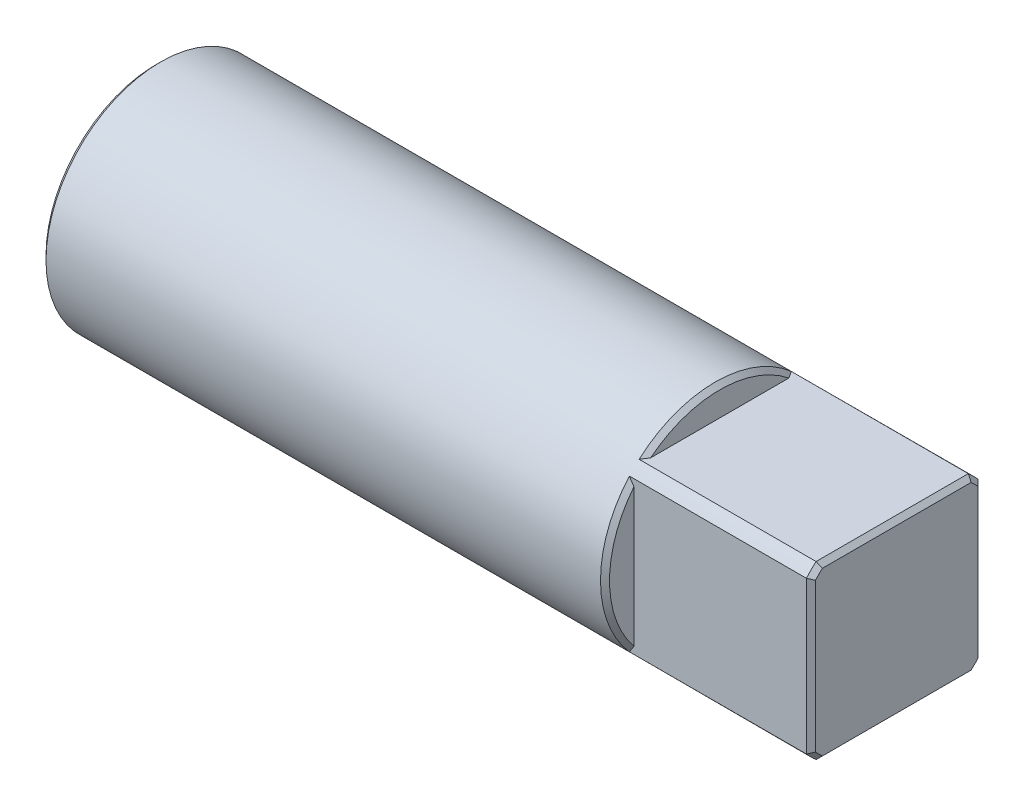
ISO-10303-21;
HEADER;
FILE_DESCRIPTION(('STEP AP214'),'2;1');
FILE_NAME('part.step','',(''),(''),'','','');
FILE_SCHEMA(('AUTOMOTIVE_DESIGN { 1 0 10303 214 1 1 1 1 }'));
ENDSEC;
DATA;
#1=APPLICATION_CONTEXT('core data for automotive mechanical design processes');
#2=APPLICATION_PROTOCOL_DEFINITION('international standard','automotive_design',2000,#1);
#3=PRODUCT_CONTEXT('',#1,'mechanical');
#4=PRODUCT('Part','Part','',(#3));
#5=PRODUCT_RELATED_PRODUCT_CATEGORY('part','',(#4));
#6=PRODUCT_DEFINITION_FORMATION('','',#4);
#7=PRODUCT_DEFINITION_CONTEXT('part definition',#1,'design');
#8=PRODUCT_DEFINITION('design','',#6,#7);
#9=PRODUCT_DEFINITION_SHAPE('','',#8);
#10=(LENGTH_UNIT() NAMED_UNIT(*) SI_UNIT(.MILLI.,.METRE.));
#11=(NAMED_UNIT(*) PLANE_ANGLE_UNIT() SI_UNIT($,.RADIAN.));
#12=(NAMED_UNIT(*) SI_UNIT($,.STERADIAN.) SOLID_ANGLE_UNIT());
#13=UNCERTAINTY_MEASURE_WITH_UNIT(LENGTH_MEASURE(1.E-05),#10,'distance_accuracy_value','');
#14=(GEOMETRIC_REPRESENTATION_CONTEXT(3) GLOBAL_UNCERTAINTY_ASSIGNED_CONTEXT((#13)) GLOBAL_UNIT_ASSIGNED_CONTEXT((#10,
#11,#12)) REPRESENTATION_CONTEXT('',''));
#15=CARTESIAN_POINT('',(0.,0.,0.));
#16=DIRECTION('',(0.,0.,1.));
#17=DIRECTION('',(1.,0.,0.));
#18=AXIS2_PLACEMENT_3D('',#15,#16,#17);
#19=CARTESIAN_POINT('',(41.,0.,0.));
#20=DIRECTION('',(-1.,0.,0.));
#21=DIRECTION('',(0.,0.,1.));
#22=AXIS2_PLACEMENT_3D('',#19,#20,#21);
#23=CYLINDRICAL_SURFACE('',#22,6.35);
#24=CARTESIAN_POINT('',(0.249999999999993,0.,0.));
#25=DIRECTION('',(1.,0.,0.));
#26=DIRECTION('',(0.,0.,-1.));
#27=AXIS2_PLACEMENT_3D('',#24,#25,#26);
#28=CIRCLE('',#27,6.35);
#29=CARTESIAN_POINT('',(0.249999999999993,0.,-6.35));
#30=VERTEX_POINT('',#29);
#31=EDGE_CURVE('E181',#30,#30,#28,.T.);
#32=ORIENTED_EDGE('',*,*,#31,.T.);
#33=EDGE_LOOP('',(#32));
#34=FACE_BOUND('',#33,.T.);
#35=DIRECTION('',(-1.,0.,0.));
#36=VECTOR('',#35,1.);
#37=CARTESIAN_POINT('',(41.,4.75,-4.2142615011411));
#38=LINE('',#37,#36);
#39=CARTESIAN_POINT('',(40.75,4.75,-4.2142615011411));
#40=VERTEX_POINT('',#39);
#41=CARTESIAN_POINT('',(30.95,4.75,-4.2142615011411));
#42=VERTEX_POINT('',#41);
#43=EDGE_CURVE('E397',#40,#42,#38,.T.);
#44=ORIENTED_EDGE('',*,*,#43,.F.);
#45=CARTESIAN_POINT('',(40.75,0.,0.));
#46=DIRECTION('',(1.,0.,0.));
#47=DIRECTION('',(0.,0.,-1.));
#48=AXIS2_PLACEMENT_3D('',#45,#46,#47);
#49=CIRCLE('',#48,6.35);
#50=CARTESIAN_POINT('',(40.75,4.21426150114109,-4.75));
#51=VERTEX_POINT('',#50);
#52=EDGE_CURVE('E207',#40,#51,#49,.F.);
#53=ORIENTED_EDGE('',*,*,#52,.T.);
#54=DIRECTION('',(-1.,0.,0.));
#55=VECTOR('',#54,1.);
#56=CARTESIAN_POINT('',(41.,4.21426150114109,-4.75));
#57=LINE('',#56,#55);
#58=CARTESIAN_POINT('',(30.95,4.21426150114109,-4.75));
#59=VERTEX_POINT('',#58);
#60=EDGE_CURVE('E438',#59,#51,#57,.F.);
#61=ORIENTED_EDGE('',*,*,#60,.F.);
#62=CARTESIAN_POINT('',(30.95,0.,0.));
#63=DIRECTION('',(1.,0.,0.));
#64=DIRECTION('',(0.,0.,-1.));
#65=AXIS2_PLACEMENT_3D('',#62,#63,#64);
#66=CIRCLE('',#65,6.35);
#67=CARTESIAN_POINT('',(30.95,-4.21426150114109,-4.75));
#68=VERTEX_POINT('',#67);
#69=EDGE_CURVE('E195',#59,#68,#66,.F.);
#70=ORIENTED_EDGE('',*,*,#69,.T.);
#71=DIRECTION('',(-1.,0.,0.));
#72=VECTOR('',#71,1.);
#73=CARTESIAN_POINT('',(41.,-4.21426150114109,-4.75));
#74=LINE('',#73,#72);
#75=CARTESIAN_POINT('',(40.75,-4.21426150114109,-4.75));
#76=VERTEX_POINT('',#75);
#77=EDGE_CURVE('E440',#76,#68,#74,.T.);
#78=ORIENTED_EDGE('',*,*,#77,.F.);
#79=CARTESIAN_POINT('',(40.75,0.,0.));
#80=DIRECTION('',(1.,0.,0.));
#81=DIRECTION('',(0.,0.,-1.));
#82=AXIS2_PLACEMENT_3D('',#79,#80,#81);
#83=CIRCLE('',#82,6.35);
#84=CARTESIAN_POINT('',(40.75,-4.75,-4.21426150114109));
#85=VERTEX_POINT('',#84);
#86=EDGE_CURVE('E205',#76,#85,#83,.F.);
#87=ORIENTED_EDGE('',*,*,#86,.T.);
#88=DIRECTION('',(-1.,0.,0.));
#89=VECTOR('',#88,1.);
#90=CARTESIAN_POINT('',(41.,-4.75,-4.21426150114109));
#91=LINE('',#90,#89);
#92=CARTESIAN_POINT('',(30.95,-4.75,-4.21426150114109));
#93=VERTEX_POINT('',#92);
#94=EDGE_CURVE('E427',#93,#85,#91,.F.);
#95=ORIENTED_EDGE('',*,*,#94,.F.);
#96=CARTESIAN_POINT('',(30.95,0.,0.));
#97=DIRECTION('',(1.,0.,0.));
#98=DIRECTION('',(0.,0.,-1.));
#99=AXIS2_PLACEMENT_3D('',#96,#97,#98);
#100=CIRCLE('',#99,6.35);
#101=CARTESIAN_POINT('',(30.95,-4.75,4.21426150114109));
#102=VERTEX_POINT('',#101);
#103=EDGE_CURVE('E198',#93,#102,#100,.F.);
#104=ORIENTED_EDGE('',*,*,#103,.T.);
#105=DIRECTION('',(-1.,0.,0.));
#106=VECTOR('',#105,1.);
#107=CARTESIAN_POINT('',(41.,-4.75,4.21426150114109));
#108=LINE('',#107,#106);
#109=CARTESIAN_POINT('',(40.75,-4.75,4.21426150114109));
#110=VERTEX_POINT('',#109);
#111=EDGE_CURVE('E395',#110,#102,#108,.T.);
#112=ORIENTED_EDGE('',*,*,#111,.F.);
#113=CARTESIAN_POINT('',(40.75,0.,0.));
#114=DIRECTION('',(1.,0.,0.));
#115=DIRECTION('',(0.,0.,-1.));
#116=AXIS2_PLACEMENT_3D('',#113,#114,#115);
#117=CIRCLE('',#116,6.35);
#118=CARTESIAN_POINT('',(40.75,-4.2142615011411,4.75));
#119=VERTEX_POINT('',#118);
#120=EDGE_CURVE('E203',#110,#119,#117,.F.);
#121=ORIENTED_EDGE('',*,*,#120,.T.);
#122=DIRECTION('',(-1.,0.,0.));
#123=VECTOR('',#122,1.);
#124=CARTESIAN_POINT('',(41.,-4.2142615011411,4.75));
#125=LINE('',#124,#123);
#126=CARTESIAN_POINT('',(30.95,-4.2142615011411,4.75));
#127=VERTEX_POINT('',#126);
#128=EDGE_CURVE('E394',#127,#119,#125,.F.);
#129=ORIENTED_EDGE('',*,*,#128,.F.);
#130=CARTESIAN_POINT('',(30.95,0.,0.));
#131=DIRECTION('',(1.,0.,0.));
#132=DIRECTION('',(0.,0.,-1.));
#133=AXIS2_PLACEMENT_3D('',#130,#131,#132);
#134=CIRCLE('',#133,6.35);
#135=CARTESIAN_POINT('',(30.95,4.2142615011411,4.75));
#136=VERTEX_POINT('',#135);
#137=EDGE_CURVE('E192',#127,#136,#134,.F.);
#138=ORIENTED_EDGE('',*,*,#137,.T.);
#139=DIRECTION('',(-1.,0.,0.));
#140=VECTOR('',#139,1.);
#141=CARTESIAN_POINT('',(41.,4.2142615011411,4.75));
#142=LINE('',#141,#140);
#143=CARTESIAN_POINT('',(40.75,4.2142615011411,4.75));
#144=VERTEX_POINT('',#143);
#145=EDGE_CURVE('E174',#144,#136,#142,.T.);
#146=ORIENTED_EDGE('',*,*,#145,.F.);
#147=CARTESIAN_POINT('',(40.75,0.,0.));
#148=DIRECTION('',(1.,0.,0.));
#149=DIRECTION('',(0.,0.,-1.));
#150=AXIS2_PLACEMENT_3D('',#147,#148,#149);
#151=CIRCLE('',#150,6.35);
#152=CARTESIAN_POINT('',(40.75,4.75,4.2142615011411));
#153=VERTEX_POINT('',#152);
#154=EDGE_CURVE('E201',#144,#153,#151,.F.);
#155=ORIENTED_EDGE('',*,*,#154,.T.);
#156=DIRECTION('',(-1.,0.,0.));
#157=VECTOR('',#156,1.);
#158=CARTESIAN_POINT('',(41.,4.75,4.2142615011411));
#159=LINE('',#158,#157);
#160=CARTESIAN_POINT('',(30.95,4.75,4.2142615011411));
#161=VERTEX_POINT('',#160);
#162=EDGE_CURVE('E400',#161,#153,#159,.F.);
#163=ORIENTED_EDGE('',*,*,#162,.F.);
#164=CARTESIAN_POINT('',(30.95,0.,0.));
#165=DIRECTION('',(1.,0.,0.));
#166=DIRECTION('',(0.,0.,-1.));
#167=AXIS2_PLACEMENT_3D('',#164,#165,#166);
#168=CIRCLE('',#167,6.35);
#169=EDGE_CURVE('E189',#161,#42,#168,.F.);
#170=ORIENTED_EDGE('',*,*,#169,.T.);
#171=EDGE_LOOP('',(#44,#53,#61,#70,#78,#87,#95,#104,#112,#121,#129,#138,#146,#155,#163,#170));
#172=FACE_BOUND('',#171,.T.);
#173=ADVANCED_FACE('F32',(#34,#172),#23,.T.);
#174=CARTESIAN_POINT('',(41.,0.,0.));
#175=DIRECTION('',(1.,0.,0.));
#176=DIRECTION('',(0.,0.,-1.));
#177=AXIS2_PLACEMENT_3D('',#174,#175,#176);
#178=PLANE('',#177);
#179=CARTESIAN_POINT('',(41.,0.,0.));
#180=DIRECTION('',(1.,0.,0.));
#181=DIRECTION('',(0.,0.,-1.));
#182=AXIS2_PLACEMENT_3D('',#179,#180,#181);
#183=CIRCLE('',#182,6.1);
#184=CARTESIAN_POINT('',(41.,4.1182520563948,-4.5));
#185=VERTEX_POINT('',#184);
#186=CARTESIAN_POINT('',(41.,4.5,-4.1182520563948));
#187=VERTEX_POINT('',#186);
#188=EDGE_CURVE('E178',#185,#187,#183,.T.);
#189=ORIENTED_EDGE('',*,*,#188,.T.);
#190=DIRECTION('',(0.,0.,1.));
#191=VECTOR('',#190,1.);
#192=CARTESIAN_POINT('',(41.,4.5,0.));
#193=LINE('',#192,#191);
#194=CARTESIAN_POINT('',(41.,4.5,4.1182520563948));
#195=VERTEX_POINT('',#194);
#196=EDGE_CURVE('E159',#187,#195,#193,.T.);
#197=ORIENTED_EDGE('',*,*,#196,.T.);
#198=CARTESIAN_POINT('',(41.,0.,0.));
#199=DIRECTION('',(1.,0.,0.));
#200=DIRECTION('',(0.,0.,-1.));
#201=AXIS2_PLACEMENT_3D('',#198,#199,#200);
#202=CIRCLE('',#201,6.1);
#203=CARTESIAN_POINT('',(41.,4.1182520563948,4.5));
#204=VERTEX_POINT('',#203);
#205=EDGE_CURVE('E167',#195,#204,#202,.T.);
#206=ORIENTED_EDGE('',*,*,#205,.T.);
#207=DIRECTION('',(0.,-1.,0.));
#208=VECTOR('',#207,1.);
#209=CARTESIAN_POINT('',(41.,0.,4.5));
#210=LINE('',#209,#208);
#211=CARTESIAN_POINT('',(41.,-4.1182520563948,4.5));
#212=VERTEX_POINT('',#211);
#213=EDGE_CURVE('E173',#204,#212,#210,.T.);
#214=ORIENTED_EDGE('',*,*,#213,.T.);
#215=CARTESIAN_POINT('',(41.,0.,0.));
#216=DIRECTION('',(1.,0.,0.));
#217=DIRECTION('',(0.,0.,-1.));
#218=AXIS2_PLACEMENT_3D('',#215,#216,#217);
#219=CIRCLE('',#218,6.1);
#220=CARTESIAN_POINT('',(41.,-4.5,4.1182520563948));
#221=VERTEX_POINT('',#220);
#222=EDGE_CURVE('E405',#212,#221,#219,.T.);
#223=ORIENTED_EDGE('',*,*,#222,.T.);
#224=DIRECTION('',(0.,0.,-1.));
#225=VECTOR('',#224,1.);
#226=CARTESIAN_POINT('',(41.,-4.5,0.));
#227=LINE('',#226,#225);
#228=CARTESIAN_POINT('',(41.,-4.5,-4.1182520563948));
#229=VERTEX_POINT('',#228);
#230=EDGE_CURVE('E387',#221,#229,#227,.T.);
#231=ORIENTED_EDGE('',*,*,#230,.T.);
#232=CARTESIAN_POINT('',(41.,0.,0.));
#233=DIRECTION('',(1.,0.,0.));
#234=DIRECTION('',(0.,0.,-1.));
#235=AXIS2_PLACEMENT_3D('',#232,#233,#234);
#236=CIRCLE('',#235,6.1);
#237=CARTESIAN_POINT('',(41.,-4.1182520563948,-4.5));
#238=VERTEX_POINT('',#237);
#239=EDGE_CURVE('E408',#229,#238,#236,.T.);
#240=ORIENTED_EDGE('',*,*,#239,.T.);
#241=DIRECTION('',(0.,1.,0.));
#242=VECTOR('',#241,1.);
#243=CARTESIAN_POINT('',(41.,0.,-4.5));
#244=LINE('',#243,#242);
#245=EDGE_CURVE('E183',#238,#185,#244,.T.);
#246=ORIENTED_EDGE('',*,*,#245,.T.);
#247=EDGE_LOOP('',(#189,#197,#206,#214,#223,#231,#240,#246));
#248=FACE_BOUND('',#247,.T.);
#249=ADVANCED_FACE('F176',(#248),#178,.T.);
#250=CARTESIAN_POINT('',(0.,0.,0.));
#251=DIRECTION('',(1.,0.,0.));
#252=DIRECTION('',(0.,0.,-1.));
#253=AXIS2_PLACEMENT_3D('',#250,#251,#252);
#254=PLANE('',#253);
#255=CARTESIAN_POINT('',(0.,0.,0.));
#256=DIRECTION('',(1.,0.,0.));
#257=DIRECTION('',(0.,0.,-1.));
#258=AXIS2_PLACEMENT_3D('',#255,#256,#257);
#259=CIRCLE('',#258,6.1);
#260=CARTESIAN_POINT('',(0.,0.,-6.1));
#261=VERTEX_POINT('',#260);
#262=EDGE_CURVE('E226',#261,#261,#259,.F.);
#263=ORIENTED_EDGE('',*,*,#262,.T.);
#264=EDGE_LOOP('',(#263));
#265=FACE_BOUND('',#264,.T.);
#266=ADVANCED_FACE('F251',(#265),#254,.F.);
#267=CARTESIAN_POINT('',(31.2,-4.75,-4.75));
#268=DIRECTION('',(0.,-1.,0.));
#269=DIRECTION('',(0.,0.,-1.));
#270=AXIS2_PLACEMENT_3D('',#267,#268,#269);
#271=PLANE('',#270);
#272=ORIENTED_EDGE('',*,*,#94,.T.);
#273=DIRECTION('',(0.,0.,1.));
#274=VECTOR('',#273,1.);
#275=CARTESIAN_POINT('',(40.75,-4.75,-4.75));
#276=LINE('',#275,#274);
#277=EDGE_CURVE('E211',#85,#110,#276,.T.);
#278=ORIENTED_EDGE('',*,*,#277,.T.);
#279=ORIENTED_EDGE('',*,*,#111,.T.);
#280=CARTESIAN_POINT('',(30.95,-4.75,4.21426150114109));
#281=CARTESIAN_POINT('',(30.9924914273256,-4.75,4.15028491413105));
#282=CARTESIAN_POINT('',(31.0345704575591,-4.75,4.08604195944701));
#283=CARTESIAN_POINT('',(31.1179037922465,-4.75,3.95702320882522));
#284=CARTESIAN_POINT('',(31.1591580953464,-4.75,3.89224741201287));
#285=CARTESIAN_POINT('',(31.2,-4.75,3.82720524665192));
#286=B_SPLINE_CURVE_WITH_KNOTS('',3,(#280,#281,#282,#283,#284,#285),.UNSPECIFIED.,.F.,.F.,(4,2,
4),(0.,0.230391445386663,0.460783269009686),.UNSPECIFIED.);
#287=CARTESIAN_POINT('',(31.2,-4.75,3.82720524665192));
#288=VERTEX_POINT('',#287);
#289=EDGE_CURVE('E237',#102,#288,#286,.T.);
#290=ORIENTED_EDGE('',*,*,#289,.T.);
#291=DIRECTION('',(0.,0.,-1.));
#292=VECTOR('',#291,1.);
#293=CARTESIAN_POINT('',(31.2,-4.75,-4.75));
#294=LINE('',#293,#292);
#295=CARTESIAN_POINT('',(31.2,-4.75,-3.82720524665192));
#296=VERTEX_POINT('',#295);
#297=EDGE_CURVE('E433',#288,#296,#294,.T.);
#298=ORIENTED_EDGE('',*,*,#297,.T.);
#299=CARTESIAN_POINT('',(31.2,-4.75,-3.82720524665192));
#300=CARTESIAN_POINT('',(31.1591580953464,-4.75,-3.89224741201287));
#301=CARTESIAN_POINT('',(31.1179037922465,-4.75,-3.95702320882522));
#302=CARTESIAN_POINT('',(31.0345704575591,-4.75,-4.08604195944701));
#303=CARTESIAN_POINT('',(30.9924914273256,-4.75,-4.15028491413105));
#304=CARTESIAN_POINT('',(30.95,-4.75,-4.2142615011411));
#305=B_SPLINE_CURVE_WITH_KNOTS('',3,(#299,#300,#301,#302,#303,#304),.UNSPECIFIED.,.F.,.F.,(4,2,
4),(0.,0.230391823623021,0.460783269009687),.UNSPECIFIED.);
#306=EDGE_CURVE('E229',#296,#93,#305,.T.);
#307=ORIENTED_EDGE('',*,*,#306,.T.);
#308=EDGE_LOOP('',(#272,#278,#279,#290,#298,#307));
#309=FACE_BOUND('',#308,.T.);
#310=ADVANCED_FACE('F245',(#309),#271,.T.);
#311=CARTESIAN_POINT('',(31.2,0.,0.));
#312=DIRECTION('',(1.,0.,0.));
#313=DIRECTION('',(0.,0.,-1.));
#314=AXIS2_PLACEMENT_3D('',#311,#312,#313);
#315=PLANE('',#314);
#316=ORIENTED_EDGE('',*,*,#297,.F.);
#317=CARTESIAN_POINT('',(31.2,0.,0.));
#318=DIRECTION('',(1.,0.,0.));
#319=DIRECTION('',(0.,0.,-1.));
#320=AXIS2_PLACEMENT_3D('',#317,#318,#319);
#321=CIRCLE('',#320,6.1);
#322=EDGE_CURVE('E215',#288,#296,#321,.T.);
#323=ORIENTED_EDGE('',*,*,#322,.T.);
#324=EDGE_LOOP('',(#316,#323));
#325=FACE_BOUND('',#324,.T.);
#326=ADVANCED_FACE('F250',(#325),#315,.T.);
#327=CARTESIAN_POINT('',(31.2,4.75,-4.75));
#328=DIRECTION('',(0.,0.,-1.));
#329=DIRECTION('',(0.,1.,0.));
#330=AXIS2_PLACEMENT_3D('',#327,#328,#329);
#331=PLANE('',#330);
#332=ORIENTED_EDGE('',*,*,#60,.T.);
#333=DIRECTION('',(0.,-1.,0.));
#334=VECTOR('',#333,1.);
#335=CARTESIAN_POINT('',(40.75,4.75,-4.75));
#336=LINE('',#335,#334);
#337=EDGE_CURVE('E209',#51,#76,#336,.T.);
#338=ORIENTED_EDGE('',*,*,#337,.T.);
#339=ORIENTED_EDGE('',*,*,#77,.T.);
#340=CARTESIAN_POINT('',(30.95,-4.21426150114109,-4.75));
#341=CARTESIAN_POINT('',(30.9924914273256,-4.15028491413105,-4.75));
#342=CARTESIAN_POINT('',(31.0345704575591,-4.08604195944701,-4.75));
#343=CARTESIAN_POINT('',(31.1179037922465,-3.95702320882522,-4.75));
#344=CARTESIAN_POINT('',(31.1591580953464,-3.89224741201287,-4.75));
#345=CARTESIAN_POINT('',(31.2,-3.82720524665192,-4.75));
#346=B_SPLINE_CURVE_WITH_KNOTS('',3,(#340,#341,#342,#343,#344,#345),.UNSPECIFIED.,.F.,.F.,(4,2,
4),(0.,0.230391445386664,0.460783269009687),.UNSPECIFIED.);
#347=CARTESIAN_POINT('',(31.2,-3.82720524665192,-4.75));
#348=VERTEX_POINT('',#347);
#349=EDGE_CURVE('E444',#68,#348,#346,.T.);
#350=ORIENTED_EDGE('',*,*,#349,.T.);
#351=DIRECTION('',(0.,1.,0.));
#352=VECTOR('',#351,1.);
#353=CARTESIAN_POINT('',(31.2,4.75,-4.75));
#354=LINE('',#353,#352);
#355=CARTESIAN_POINT('',(31.2,3.82720524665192,-4.75));
#356=VERTEX_POINT('',#355);
#357=EDGE_CURVE('E428',#348,#356,#354,.T.);
#358=ORIENTED_EDGE('',*,*,#357,.T.);
#359=CARTESIAN_POINT('',(31.2,3.82720524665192,-4.75));
#360=CARTESIAN_POINT('',(31.1591580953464,3.89224741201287,-4.75));
#361=CARTESIAN_POINT('',(31.1179037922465,3.95702320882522,-4.75));
#362=CARTESIAN_POINT('',(31.0345704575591,4.08604195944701,-4.75));
#363=CARTESIAN_POINT('',(30.9924914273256,4.15028491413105,-4.75));
#364=CARTESIAN_POINT('',(30.95,4.2142615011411,-4.75));
#365=B_SPLINE_CURVE_WITH_KNOTS('',3,(#359,#360,#361,#362,#363,#364),.UNSPECIFIED.,.F.,.F.,(4,2,
4),(0.,0.230391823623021,0.460783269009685),.UNSPECIFIED.);
#366=EDGE_CURVE('E451',#356,#59,#365,.T.);
#367=ORIENTED_EDGE('',*,*,#366,.T.);
#368=EDGE_LOOP('',(#332,#338,#339,#350,#358,#367));
#369=FACE_BOUND('',#368,.T.);
#370=ADVANCED_FACE('F253',(#369),#331,.T.);
#371=ORIENTED_EDGE('',*,*,#357,.F.);
#372=CARTESIAN_POINT('',(31.2,0.,0.));
#373=DIRECTION('',(1.,0.,0.));
#374=DIRECTION('',(0.,0.,-1.));
#375=AXIS2_PLACEMENT_3D('',#372,#373,#374);
#376=CIRCLE('',#375,6.1);
#377=EDGE_CURVE('E218',#348,#356,#376,.T.);
#378=ORIENTED_EDGE('',*,*,#377,.T.);
#379=EDGE_LOOP('',(#371,#378));
#380=FACE_BOUND('',#379,.T.);
#381=ADVANCED_FACE('F303',(#380),#315,.T.);
#382=CARTESIAN_POINT('',(31.2,4.75,-4.75));
#383=DIRECTION('',(0.,1.,0.));
#384=DIRECTION('',(0.,0.,1.));
#385=AXIS2_PLACEMENT_3D('',#382,#383,#384);
#386=PLANE('',#385);
#387=ORIENTED_EDGE('',*,*,#162,.T.);
#388=DIRECTION('',(0.,0.,-1.));
#389=VECTOR('',#388,1.);
#390=CARTESIAN_POINT('',(40.75,4.75,-4.75));
#391=LINE('',#390,#389);
#392=EDGE_CURVE('E161',#153,#40,#391,.T.);
#393=ORIENTED_EDGE('',*,*,#392,.T.);
#394=ORIENTED_EDGE('',*,*,#43,.T.);
#395=CARTESIAN_POINT('',(30.95,4.75,-4.2142615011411));
#396=CARTESIAN_POINT('',(30.9924914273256,4.75,-4.15028491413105));
#397=CARTESIAN_POINT('',(31.0345704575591,4.75,-4.08604195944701));
#398=CARTESIAN_POINT('',(31.1179037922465,4.75,-3.95702320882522));
#399=CARTESIAN_POINT('',(31.1591580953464,4.75,-3.89224741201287));
#400=CARTESIAN_POINT('',(31.2,4.75,-3.82720524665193));
#401=B_SPLINE_CURVE_WITH_KNOTS('',3,(#395,#396,#397,#398,#399,#400),.UNSPECIFIED.,.F.,.F.,(4,2,
4),(0.,0.230391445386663,0.460783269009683),.UNSPECIFIED.);
#402=CARTESIAN_POINT('',(31.2,4.75,-3.82720524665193));
#403=VERTEX_POINT('',#402);
#404=EDGE_CURVE('E12',#42,#403,#401,.T.);
#405=ORIENTED_EDGE('',*,*,#404,.T.);
#406=DIRECTION('',(0.,0.,1.));
#407=VECTOR('',#406,1.);
#408=CARTESIAN_POINT('',(31.2,4.75,-4.75));
#409=LINE('',#408,#407);
#410=CARTESIAN_POINT('',(31.2,4.75,3.82720524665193));
#411=VERTEX_POINT('',#410);
#412=EDGE_CURVE('E426',#403,#411,#409,.T.);
#413=ORIENTED_EDGE('',*,*,#412,.T.);
#414=CARTESIAN_POINT('',(31.2,4.75,3.82720524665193));
#415=CARTESIAN_POINT('',(31.1591580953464,4.75,3.89224741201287));
#416=CARTESIAN_POINT('',(31.1179037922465,4.75,3.95702320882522));
#417=CARTESIAN_POINT('',(31.0345704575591,4.75,4.08604195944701));
#418=CARTESIAN_POINT('',(30.9924914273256,4.75,4.15028491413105));
#419=CARTESIAN_POINT('',(30.95,4.75,4.2142615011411));
#420=B_SPLINE_CURVE_WITH_KNOTS('',3,(#414,#415,#416,#417,#418,#419),.UNSPECIFIED.,.F.,.F.,(4,2,
4),(0.,0.230391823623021,0.460783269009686),.UNSPECIFIED.);
#421=EDGE_CURVE('E46',#411,#161,#420,.T.);
#422=ORIENTED_EDGE('',*,*,#421,.T.);
#423=EDGE_LOOP('',(#387,#393,#394,#405,#413,#422));
#424=FACE_BOUND('',#423,.T.);
#425=ADVANCED_FACE('F300',(#424),#386,.T.);
#426=ORIENTED_EDGE('',*,*,#412,.F.);
#427=CARTESIAN_POINT('',(31.2,0.,0.));
#428=DIRECTION('',(1.,0.,0.));
#429=DIRECTION('',(0.,0.,-1.));
#430=AXIS2_PLACEMENT_3D('',#427,#428,#429);
#431=CIRCLE('',#430,6.1);
#432=EDGE_CURVE('E223',#403,#411,#431,.T.);
#433=ORIENTED_EDGE('',*,*,#432,.T.);
#434=EDGE_LOOP('',(#426,#433));
#435=FACE_BOUND('',#434,.T.);
#436=ADVANCED_FACE('F263',(#435),#315,.T.);
#437=DIRECTION('',(0.,-1.,0.));
#438=VECTOR('',#437,1.);
#439=CARTESIAN_POINT('',(31.2,4.75,4.75));
#440=LINE('',#439,#438);
#441=CARTESIAN_POINT('',(31.2,3.82720524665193,4.75));
#442=VERTEX_POINT('',#441);
#443=CARTESIAN_POINT('',(31.2,-3.82720524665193,4.75));
#444=VERTEX_POINT('',#443);
#445=EDGE_CURVE('E465',#442,#444,#440,.T.);
#446=ORIENTED_EDGE('',*,*,#445,.F.);
#447=CARTESIAN_POINT('',(31.2,0.,0.));
#448=DIRECTION('',(1.,0.,0.));
#449=DIRECTION('',(0.,0.,-1.));
#450=AXIS2_PLACEMENT_3D('',#447,#448,#449);
#451=CIRCLE('',#450,6.1);
#452=EDGE_CURVE('E221',#442,#444,#451,.T.);
#453=ORIENTED_EDGE('',*,*,#452,.T.);
#454=EDGE_LOOP('',(#446,#453));
#455=FACE_BOUND('',#454,.T.);
#456=ADVANCED_FACE('F262',(#455),#315,.T.);
#457=CARTESIAN_POINT('',(31.2,4.75,4.75));
#458=DIRECTION('',(0.,0.,1.));
#459=DIRECTION('',(1.,0.,0.));
#460=AXIS2_PLACEMENT_3D('',#457,#458,#459);
#461=PLANE('',#460);
#462=ORIENTED_EDGE('',*,*,#128,.T.);
#463=DIRECTION('',(0.,1.,0.));
#464=VECTOR('',#463,1.);
#465=CARTESIAN_POINT('',(40.75,4.75,4.75));
#466=LINE('',#465,#464);
#467=EDGE_CURVE('E213',#119,#144,#466,.T.);
#468=ORIENTED_EDGE('',*,*,#467,.T.);
#469=ORIENTED_EDGE('',*,*,#145,.T.);
#470=CARTESIAN_POINT('',(30.95,4.2142615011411,4.75));
#471=CARTESIAN_POINT('',(30.9924914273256,4.15028491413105,4.75));
#472=CARTESIAN_POINT('',(31.0345704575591,4.08604195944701,4.75));
#473=CARTESIAN_POINT('',(31.1179037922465,3.95702320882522,4.75));
#474=CARTESIAN_POINT('',(31.1591580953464,3.89224741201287,4.75));
#475=CARTESIAN_POINT('',(31.2,3.82720524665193,4.75));
#476=B_SPLINE_CURVE_WITH_KNOTS('',3,(#470,#471,#472,#473,#474,#475),.UNSPECIFIED.,.F.,.F.,(4,2,
4),(0.,0.230391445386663,0.460783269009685),.UNSPECIFIED.);
#477=EDGE_CURVE('E62',#136,#442,#476,.T.);
#478=ORIENTED_EDGE('',*,*,#477,.T.);
#479=ORIENTED_EDGE('',*,*,#445,.T.);
#480=CARTESIAN_POINT('',(31.2,-3.82720524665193,4.75));
#481=CARTESIAN_POINT('',(31.1591580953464,-3.89224741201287,4.75));
#482=CARTESIAN_POINT('',(31.1179037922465,-3.95702320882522,4.75));
#483=CARTESIAN_POINT('',(31.0345704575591,-4.08604195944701,4.75));
#484=CARTESIAN_POINT('',(30.9924914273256,-4.15028491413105,4.75));
#485=CARTESIAN_POINT('',(30.95,-4.2142615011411,4.75));
#486=B_SPLINE_CURVE_WITH_KNOTS('',3,(#480,#481,#482,#483,#484,#485),.UNSPECIFIED.,.F.,.F.,(4,2,
4),(0.,0.230391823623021,0.460783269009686),.UNSPECIFIED.);
#487=EDGE_CURVE('E54',#444,#127,#486,.T.);
#488=ORIENTED_EDGE('',*,*,#487,.T.);
#489=EDGE_LOOP('',(#462,#468,#469,#478,#479,#488));
#490=FACE_BOUND('',#489,.T.);
#491=ADVANCED_FACE('F256',(#490),#461,.T.);
#492=CARTESIAN_POINT('',(41.,-4.5,0.));
#493=DIRECTION('',(-0.707106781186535,0.70710678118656,0.));
#494=DIRECTION('',(-0.70710678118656,-0.707106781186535,0.));
#495=AXIS2_PLACEMENT_3D('',#492,#493,#494);
#496=PLANE('',#495);
#497=CARTESIAN_POINT('',(40.75,-4.75,4.21426150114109));
#498=CARTESIAN_POINT('',(40.7916996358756,-4.70830036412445,4.19843163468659));
#499=CARTESIAN_POINT('',(40.8333827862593,-4.66661721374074,4.18251591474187));
#500=CARTESIAN_POINT('',(40.9167161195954,-4.58328388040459,4.15051276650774));
#501=CARTESIAN_POINT('',(40.958366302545,-4.54163369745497,4.1344253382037));
#502=CARTESIAN_POINT('',(41.,-4.5,4.1182520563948));
#503=B_SPLINE_CURVE_WITH_KNOTS('',3,(#497,#498,#499,#500,#501,#502),.UNSPECIFIED.,.F.,.F.,(4,2,
4),(0.,0.183178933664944,0.36635788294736),.UNSPECIFIED.);
#504=EDGE_CURVE('E368',#110,#221,#503,.T.);
#505=ORIENTED_EDGE('',*,*,#504,.F.);
#506=ORIENTED_EDGE('',*,*,#277,.F.);
#507=CARTESIAN_POINT('',(40.75,-4.75,-4.21426150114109));
#508=CARTESIAN_POINT('',(40.7916996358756,-4.70830036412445,-4.19843163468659));
#509=CARTESIAN_POINT('',(40.8333827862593,-4.66661721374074,-4.18251591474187));
#510=CARTESIAN_POINT('',(40.9167161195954,-4.58328388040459,-4.15051276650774));
#511=CARTESIAN_POINT('',(40.958366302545,-4.54163369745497,-4.1344253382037));
#512=CARTESIAN_POINT('',(41.,-4.5,-4.1182520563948));
#513=B_SPLINE_CURVE_WITH_KNOTS('',3,(#507,#508,#509,#510,#511,#512),.UNSPECIFIED.,.F.,.F.,(4,2,
4),(0.,0.183178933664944,0.36635788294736),.UNSPECIFIED.);
#514=EDGE_CURVE('E36',#229,#85,#513,.F.);
#515=ORIENTED_EDGE('',*,*,#514,.F.);
#516=ORIENTED_EDGE('',*,*,#230,.F.);
#517=EDGE_LOOP('',(#505,#506,#515,#516));
#518=FACE_BOUND('',#517,.T.);
#519=ADVANCED_FACE('F261',(#518),#496,.F.);
#520=CARTESIAN_POINT('',(41.,0.,0.));
#521=DIRECTION('',(-1.,0.,0.));
#522=DIRECTION('',(0.,0.,1.));
#523=AXIS2_PLACEMENT_3D('',#520,#521,#522);
#524=CONICAL_SURFACE('',#523,6.1,0.785398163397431);
#525=ORIENTED_EDGE('',*,*,#514,.T.);
#526=ORIENTED_EDGE('',*,*,#86,.F.);
#527=CARTESIAN_POINT('',(40.75,-4.21426150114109,-4.75));
#528=CARTESIAN_POINT('',(40.7916996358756,-4.19843163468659,-4.70830036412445));
#529=CARTESIAN_POINT('',(40.8333827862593,-4.18251591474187,-4.66661721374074));
#530=CARTESIAN_POINT('',(40.9167161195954,-4.15051276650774,-4.58328388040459));
#531=CARTESIAN_POINT('',(40.958366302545,-4.1344253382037,-4.54163369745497));
#532=CARTESIAN_POINT('',(41.,-4.1182520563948,-4.5));
#533=B_SPLINE_CURVE_WITH_KNOTS('',3,(#527,#528,#529,#530,#531,#532),.UNSPECIFIED.,.F.,.F.,(4,2,
4),(0.,0.183178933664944,0.36635788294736),.UNSPECIFIED.);
#534=EDGE_CURVE('E357',#238,#76,#533,.F.);
#535=ORIENTED_EDGE('',*,*,#534,.F.);
#536=ORIENTED_EDGE('',*,*,#239,.F.);
#537=EDGE_LOOP('',(#525,#526,#535,#536));
#538=FACE_BOUND('',#537,.T.);
#539=ADVANCED_FACE('F364',(#538),#524,.T.);
#540=CARTESIAN_POINT('',(41.,0.,0.));
#541=DIRECTION('',(-1.,0.,0.));
#542=DIRECTION('',(0.,0.,1.));
#543=AXIS2_PLACEMENT_3D('',#540,#541,#542);
#544=CONICAL_SURFACE('',#543,6.1,0.785398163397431);
#545=ORIENTED_EDGE('',*,*,#504,.T.);
#546=ORIENTED_EDGE('',*,*,#222,.F.);
#547=CARTESIAN_POINT('',(40.75,-4.2142615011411,4.75));
#548=CARTESIAN_POINT('',(40.7916996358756,-4.19843163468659,4.70830036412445));
#549=CARTESIAN_POINT('',(40.8333827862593,-4.18251591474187,4.66661721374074));
#550=CARTESIAN_POINT('',(40.9167161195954,-4.15051276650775,4.58328388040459));
#551=CARTESIAN_POINT('',(40.958366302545,-4.1344253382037,4.54163369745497));
#552=CARTESIAN_POINT('',(41.,-4.1182520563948,4.5));
#553=B_SPLINE_CURVE_WITH_KNOTS('',3,(#547,#548,#549,#550,#551,#552),.UNSPECIFIED.,.F.,.F.,(4,2,
4),(0.,0.183178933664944,0.36635788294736),.UNSPECIFIED.);
#554=EDGE_CURVE('E351',#119,#212,#553,.T.);
#555=ORIENTED_EDGE('',*,*,#554,.F.);
#556=ORIENTED_EDGE('',*,*,#120,.F.);
#557=EDGE_LOOP('',(#545,#546,#555,#556));
#558=FACE_BOUND('',#557,.T.);
#559=ADVANCED_FACE('F361',(#558),#544,.T.);
#560=CARTESIAN_POINT('',(41.,0.,-4.5));
#561=DIRECTION('',(-0.707106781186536,0.,0.707106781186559));
#562=DIRECTION('',(0.707106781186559,0.,0.707106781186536));
#563=AXIS2_PLACEMENT_3D('',#560,#561,#562);
#564=PLANE('',#563);
#565=ORIENTED_EDGE('',*,*,#534,.T.);
#566=ORIENTED_EDGE('',*,*,#337,.F.);
#567=CARTESIAN_POINT('',(40.75,4.21426150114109,-4.75));
#568=CARTESIAN_POINT('',(40.7916996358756,4.19843163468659,-4.70830036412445));
#569=CARTESIAN_POINT('',(40.8333827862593,4.18251591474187,-4.66661721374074));
#570=CARTESIAN_POINT('',(40.9167161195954,4.15051276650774,-4.58328388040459));
#571=CARTESIAN_POINT('',(40.958366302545,4.1344253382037,-4.54163369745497));
#572=CARTESIAN_POINT('',(41.,4.1182520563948,-4.5));
#573=B_SPLINE_CURVE_WITH_KNOTS('',3,(#567,#568,#569,#570,#571,#572),.UNSPECIFIED.,.F.,.F.,(4,2,
4),(0.,0.183178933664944,0.36635788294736),.UNSPECIFIED.);
#574=EDGE_CURVE('E333',#185,#51,#573,.F.);
#575=ORIENTED_EDGE('',*,*,#574,.F.);
#576=ORIENTED_EDGE('',*,*,#245,.F.);
#577=EDGE_LOOP('',(#565,#566,#575,#576));
#578=FACE_BOUND('',#577,.T.);
#579=ADVANCED_FACE('F345',(#578),#564,.F.);
#580=CARTESIAN_POINT('',(41.,0.,4.5));
#581=DIRECTION('',(-0.707106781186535,0.,-0.70710678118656));
#582=DIRECTION('',(-0.70710678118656,0.,0.707106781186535));
#583=AXIS2_PLACEMENT_3D('',#580,#581,#582);
#584=PLANE('',#583);
#585=ORIENTED_EDGE('',*,*,#554,.T.);
#586=ORIENTED_EDGE('',*,*,#213,.F.);
#587=CARTESIAN_POINT('',(40.75,4.2142615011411,4.75));
#588=CARTESIAN_POINT('',(40.7916996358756,4.19843163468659,4.70830036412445));
#589=CARTESIAN_POINT('',(40.8333827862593,4.18251591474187,4.66661721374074));
#590=CARTESIAN_POINT('',(40.9167161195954,4.15051276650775,4.58328388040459));
#591=CARTESIAN_POINT('',(40.958366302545,4.1344253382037,4.54163369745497));
#592=CARTESIAN_POINT('',(41.,4.1182520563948,4.5));
#593=B_SPLINE_CURVE_WITH_KNOTS('',3,(#587,#588,#589,#590,#591,#592),.UNSPECIFIED.,.F.,.F.,(4,2,
4),(0.,0.183178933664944,0.36635788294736),.UNSPECIFIED.);
#594=EDGE_CURVE('E170',#144,#204,#593,.T.);
#595=ORIENTED_EDGE('',*,*,#594,.F.);
#596=ORIENTED_EDGE('',*,*,#467,.F.);
#597=EDGE_LOOP('',(#585,#586,#595,#596));
#598=FACE_BOUND('',#597,.T.);
#599=ADVANCED_FACE('F342',(#598),#584,.F.);
#600=CARTESIAN_POINT('',(41.,0.,0.));
#601=DIRECTION('',(-1.,0.,0.));
#602=DIRECTION('',(0.,0.,1.));
#603=AXIS2_PLACEMENT_3D('',#600,#601,#602);
#604=CONICAL_SURFACE('',#603,6.1,0.785398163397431);
#605=ORIENTED_EDGE('',*,*,#574,.T.);
#606=ORIENTED_EDGE('',*,*,#52,.F.);
#607=CARTESIAN_POINT('',(40.75,4.75,-4.2142615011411));
#608=CARTESIAN_POINT('',(40.7916996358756,4.70830036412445,-4.19843163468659));
#609=CARTESIAN_POINT('',(40.8333827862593,4.66661721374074,-4.18251591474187));
#610=CARTESIAN_POINT('',(40.9167161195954,4.58328388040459,-4.15051276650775));
#611=CARTESIAN_POINT('',(40.958366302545,4.54163369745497,-4.1344253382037));
#612=CARTESIAN_POINT('',(41.,4.5,-4.1182520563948));
#613=B_SPLINE_CURVE_WITH_KNOTS('',3,(#607,#608,#609,#610,#611,#612),.UNSPECIFIED.,.F.,.F.,(4,2,
4),(0.,0.183178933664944,0.36635788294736),.UNSPECIFIED.);
#614=EDGE_CURVE('E164',#187,#40,#613,.F.);
#615=ORIENTED_EDGE('',*,*,#614,.F.);
#616=ORIENTED_EDGE('',*,*,#188,.F.);
#617=EDGE_LOOP('',(#605,#606,#615,#616));
#618=FACE_BOUND('',#617,.T.);
#619=ADVANCED_FACE('F323',(#618),#604,.T.);
#620=CARTESIAN_POINT('',(41.,0.,0.));
#621=DIRECTION('',(-1.,0.,0.));
#622=DIRECTION('',(0.,0.,1.));
#623=AXIS2_PLACEMENT_3D('',#620,#621,#622);
#624=CONICAL_SURFACE('',#623,6.1,0.785398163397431);
#625=ORIENTED_EDGE('',*,*,#594,.T.);
#626=ORIENTED_EDGE('',*,*,#205,.F.);
#627=CARTESIAN_POINT('',(41.,4.5,4.1182520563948));
#628=CARTESIAN_POINT('',(40.958366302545,4.54163369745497,4.1344253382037));
#629=CARTESIAN_POINT('',(40.9167161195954,4.58328388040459,4.15051276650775));
#630=CARTESIAN_POINT('',(40.8333827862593,4.66661721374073,4.18251591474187));
#631=CARTESIAN_POINT('',(40.7916996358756,4.70830036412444,4.19843163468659));
#632=CARTESIAN_POINT('',(40.75,4.75,4.2142615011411));
#633=B_SPLINE_CURVE_WITH_KNOTS('',3,(#627,#628,#629,#630,#631,#632),.UNSPECIFIED.,.F.,.F.,(4,2,
4),(0.,0.183178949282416,0.366357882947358),.UNSPECIFIED.);
#634=EDGE_CURVE('E155',#153,#195,#633,.F.);
#635=ORIENTED_EDGE('',*,*,#634,.F.);
#636=ORIENTED_EDGE('',*,*,#154,.F.);
#637=EDGE_LOOP('',(#625,#626,#635,#636));
#638=FACE_BOUND('',#637,.T.);
#639=ADVANCED_FACE('F168',(#638),#624,.T.);
#640=CARTESIAN_POINT('',(41.,4.5,0.));
#641=DIRECTION('',(-0.707106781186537,-0.707106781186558,0.));
#642=DIRECTION('',(0.707106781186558,-0.707106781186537,0.));
#643=AXIS2_PLACEMENT_3D('',#640,#641,#642);
#644=PLANE('',#643);
#645=ORIENTED_EDGE('',*,*,#614,.T.);
#646=ORIENTED_EDGE('',*,*,#392,.F.);
#647=ORIENTED_EDGE('',*,*,#634,.T.);
#648=ORIENTED_EDGE('',*,*,#196,.F.);
#649=EDGE_LOOP('',(#645,#646,#647,#648));
#650=FACE_BOUND('',#649,.T.);
#651=ADVANCED_FACE('F157',(#650),#644,.F.);
#652=CARTESIAN_POINT('',(31.2,0.,0.));
#653=DIRECTION('',(-1.,0.,0.));
#654=DIRECTION('',(0.,0.,1.));
#655=AXIS2_PLACEMENT_3D('',#652,#653,#654);
#656=CONICAL_SURFACE('',#655,6.1,0.785398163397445);
#657=ORIENTED_EDGE('',*,*,#289,.F.);
#658=ORIENTED_EDGE('',*,*,#103,.F.);
#659=ORIENTED_EDGE('',*,*,#306,.F.);
#660=ORIENTED_EDGE('',*,*,#322,.F.);
#661=EDGE_LOOP('',(#657,#658,#659,#660));
#662=FACE_BOUND('',#661,.T.);
#663=ADVANCED_FACE('F242',(#662),#656,.T.);
#664=CARTESIAN_POINT('',(31.2,0.,0.));
#665=DIRECTION('',(-1.,0.,0.));
#666=DIRECTION('',(0.,0.,1.));
#667=AXIS2_PLACEMENT_3D('',#664,#665,#666);
#668=CONICAL_SURFACE('',#667,6.1,0.785398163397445);
#669=ORIENTED_EDGE('',*,*,#349,.F.);
#670=ORIENTED_EDGE('',*,*,#69,.F.);
#671=ORIENTED_EDGE('',*,*,#366,.F.);
#672=ORIENTED_EDGE('',*,*,#377,.F.);
#673=EDGE_LOOP('',(#669,#670,#671,#672));
#674=FACE_BOUND('',#673,.T.);
#675=ADVANCED_FACE('F284',(#674),#668,.T.);
#676=CARTESIAN_POINT('',(31.2,0.,0.));
#677=DIRECTION('',(-1.,0.,0.));
#678=DIRECTION('',(0.,0.,1.));
#679=AXIS2_PLACEMENT_3D('',#676,#677,#678);
#680=CONICAL_SURFACE('',#679,6.1,0.785398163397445);
#681=ORIENTED_EDGE('',*,*,#477,.F.);
#682=ORIENTED_EDGE('',*,*,#137,.F.);
#683=ORIENTED_EDGE('',*,*,#487,.F.);
#684=ORIENTED_EDGE('',*,*,#452,.F.);
#685=EDGE_LOOP('',(#681,#682,#683,#684));
#686=FACE_BOUND('',#685,.T.);
#687=ADVANCED_FACE('F280',(#686),#680,.T.);
#688=CARTESIAN_POINT('',(31.2,0.,0.));
#689=DIRECTION('',(-1.,0.,0.));
#690=DIRECTION('',(0.,0.,1.));
#691=AXIS2_PLACEMENT_3D('',#688,#689,#690);
#692=CONICAL_SURFACE('',#691,6.1,0.785398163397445);
#693=ORIENTED_EDGE('',*,*,#404,.F.);
#694=ORIENTED_EDGE('',*,*,#169,.F.);
#695=ORIENTED_EDGE('',*,*,#421,.F.);
#696=ORIENTED_EDGE('',*,*,#432,.F.);
#697=EDGE_LOOP('',(#693,#694,#695,#696));
#698=FACE_BOUND('',#697,.T.);
#699=ADVANCED_FACE('F283',(#698),#692,.T.);
#700=CARTESIAN_POINT('',(0.249999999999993,0.,0.));
#701=DIRECTION('',(1.,0.,0.));
#702=DIRECTION('',(0.,0.,-1.));
#703=AXIS2_PLACEMENT_3D('',#700,#701,#702);
#704=CONICAL_SURFACE('',#703,6.35,0.785398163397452);
#705=ORIENTED_EDGE('',*,*,#262,.F.);
#706=EDGE_LOOP('',(#705));
#707=FACE_BOUND('',#706,.T.);
#708=ORIENTED_EDGE('',*,*,#31,.F.);
#709=EDGE_LOOP('',(#708));
#710=FACE_BOUND('',#709,.T.);
#711=ADVANCED_FACE('F34',(#707,#710),#704,.T.);
#712=CLOSED_SHELL('',(#173,#249,#266,#310,#326,#370,#381,#425,#436,#456,#491,#519,#539,#559,
#579,#599,#619,#639,#651,#663,#675,#687,#699,#711));
#713=MANIFOLD_SOLID_BREP('B2',#712);
#714=ADVANCED_BREP_SHAPE_REPRESENTATION('',(#18,#713),#14);
#715=SHAPE_DEFINITION_REPRESENTATION(#9,#714);
ENDSEC;
END-ISO-10303-21;
